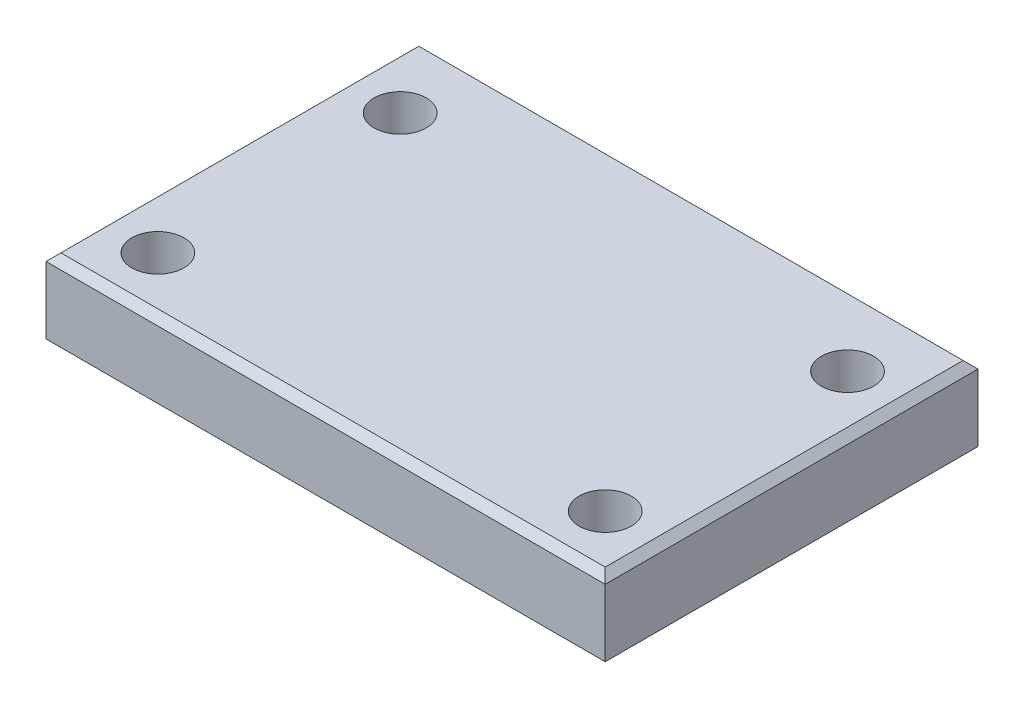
ISO-10303-21;
HEADER;
FILE_DESCRIPTION(('STEP AP214'),'2;1');
FILE_NAME('part.step','',(''),(''),'','','');
FILE_SCHEMA(('AUTOMOTIVE_DESIGN { 1 0 10303 214 1 1 1 1 }'));
ENDSEC;
DATA;
#1=APPLICATION_CONTEXT('core data for automotive mechanical design processes');
#2=APPLICATION_PROTOCOL_DEFINITION('international standard','automotive_design',2000,#1);
#3=PRODUCT_CONTEXT('',#1,'mechanical');
#4=PRODUCT('Part','Part','',(#3));
#5=PRODUCT_RELATED_PRODUCT_CATEGORY('part','',(#4));
#6=PRODUCT_DEFINITION_FORMATION('','',#4);
#7=PRODUCT_DEFINITION_CONTEXT('part definition',#1,'design');
#8=PRODUCT_DEFINITION('design','',#6,#7);
#9=PRODUCT_DEFINITION_SHAPE('','',#8);
#10=(LENGTH_UNIT() NAMED_UNIT(*) SI_UNIT(.MILLI.,.METRE.));
#11=(NAMED_UNIT(*) PLANE_ANGLE_UNIT() SI_UNIT($,.RADIAN.));
#12=(NAMED_UNIT(*) SI_UNIT($,.STERADIAN.) SOLID_ANGLE_UNIT());
#13=UNCERTAINTY_MEASURE_WITH_UNIT(LENGTH_MEASURE(1.E-05),#10,'distance_accuracy_value','');
#14=(GEOMETRIC_REPRESENTATION_CONTEXT(3) GLOBAL_UNCERTAINTY_ASSIGNED_CONTEXT((#13)) GLOBAL_UNIT_ASSIGNED_CONTEXT((#10,
#11,#12)) REPRESENTATION_CONTEXT('',''));
#15=CARTESIAN_POINT('',(0.,0.,0.));
#16=DIRECTION('',(0.,0.,1.));
#17=DIRECTION('',(1.,0.,0.));
#18=AXIS2_PLACEMENT_3D('',#15,#16,#17);
#19=CARTESIAN_POINT('',(-75.,20.,-50.));
#20=DIRECTION('',(1.,0.,0.));
#21=DIRECTION('',(0.,0.,-1.));
#22=AXIS2_PLACEMENT_3D('',#19,#20,#21);
#23=PLANE('',#22);
#24=DIRECTION('',(0.,-1.,0.));
#25=VECTOR('',#24,1.);
#26=CARTESIAN_POINT('',(-75.,20.,50.));
#27=LINE('',#26,#25);
#28=CARTESIAN_POINT('',(-75.,18.,50.));
#29=VERTEX_POINT('',#28);
#30=CARTESIAN_POINT('',(-75.,0.,50.));
#31=VERTEX_POINT('',#30);
#32=EDGE_CURVE('E80',#29,#31,#27,.T.);
#33=ORIENTED_EDGE('',*,*,#32,.F.);
#34=DIRECTION('',(0.,0.,-1.));
#35=VECTOR('',#34,1.);
#36=CARTESIAN_POINT('',(-75.,18.,-50.));
#37=LINE('',#36,#35);
#38=CARTESIAN_POINT('',(-75.,18.,-50.));
#39=VERTEX_POINT('',#38);
#40=EDGE_CURVE('E127',#29,#39,#37,.T.);
#41=ORIENTED_EDGE('',*,*,#40,.T.);
#42=DIRECTION('',(0.,-1.,0.));
#43=VECTOR('',#42,1.);
#44=CARTESIAN_POINT('',(-75.,20.,-50.));
#45=LINE('',#44,#43);
#46=CARTESIAN_POINT('',(-75.,0.,-50.));
#47=VERTEX_POINT('',#46);
#48=EDGE_CURVE('E103',#39,#47,#45,.T.);
#49=ORIENTED_EDGE('',*,*,#48,.T.);
#50=DIRECTION('',(0.,0.,1.));
#51=VECTOR('',#50,1.);
#52=CARTESIAN_POINT('',(-75.,0.,-50.));
#53=LINE('',#52,#51);
#54=EDGE_CURVE('E99',#47,#31,#53,.T.);
#55=ORIENTED_EDGE('',*,*,#54,.T.);
#56=EDGE_LOOP('',(#33,#41,#49,#55));
#57=FACE_BOUND('',#56,.T.);
#58=ADVANCED_FACE('F26',(#57),#23,.F.);
#59=CARTESIAN_POINT('',(-75.,20.,50.));
#60=DIRECTION('',(0.,0.,-1.));
#61=DIRECTION('',(-1.,0.,0.));
#62=AXIS2_PLACEMENT_3D('',#59,#60,#61);
#63=PLANE('',#62);
#64=DIRECTION('',(0.,-1.,0.));
#65=VECTOR('',#64,1.);
#66=CARTESIAN_POINT('',(75.,20.,50.));
#67=LINE('',#66,#65);
#68=CARTESIAN_POINT('',(75.,18.,50.));
#69=VERTEX_POINT('',#68);
#70=CARTESIAN_POINT('',(75.,0.,50.));
#71=VERTEX_POINT('',#70);
#72=EDGE_CURVE('E92',#69,#71,#67,.T.);
#73=ORIENTED_EDGE('',*,*,#72,.F.);
#74=DIRECTION('',(-1.,0.,0.));
#75=VECTOR('',#74,1.);
#76=CARTESIAN_POINT('',(-75.,18.,50.));
#77=LINE('',#76,#75);
#78=EDGE_CURVE('E86',#69,#29,#77,.T.);
#79=ORIENTED_EDGE('',*,*,#78,.T.);
#80=ORIENTED_EDGE('',*,*,#32,.T.);
#81=DIRECTION('',(1.,0.,0.));
#82=VECTOR('',#81,1.);
#83=CARTESIAN_POINT('',(-75.,0.,50.));
#84=LINE('',#83,#82);
#85=EDGE_CURVE('E83',#31,#71,#84,.T.);
#86=ORIENTED_EDGE('',*,*,#85,.T.);
#87=EDGE_LOOP('',(#73,#79,#80,#86));
#88=FACE_BOUND('',#87,.T.);
#89=ADVANCED_FACE('F82',(#88),#63,.F.);
#90=CARTESIAN_POINT('',(75.,20.,-50.));
#91=DIRECTION('',(-1.,0.,0.));
#92=DIRECTION('',(0.,0.,1.));
#93=AXIS2_PLACEMENT_3D('',#90,#91,#92);
#94=PLANE('',#93);
#95=DIRECTION('',(0.,-1.,0.));
#96=VECTOR('',#95,1.);
#97=CARTESIAN_POINT('',(75.,20.,-50.));
#98=LINE('',#97,#96);
#99=CARTESIAN_POINT('',(75.,18.,-50.));
#100=VERTEX_POINT('',#99);
#101=CARTESIAN_POINT('',(75.,0.,-50.));
#102=VERTEX_POINT('',#101);
#103=EDGE_CURVE('E116',#100,#102,#98,.T.);
#104=ORIENTED_EDGE('',*,*,#103,.F.);
#105=DIRECTION('',(0.,0.,1.));
#106=VECTOR('',#105,1.);
#107=CARTESIAN_POINT('',(75.,18.,50.));
#108=LINE('',#107,#106);
#109=EDGE_CURVE('E41',#100,#69,#108,.T.);
#110=ORIENTED_EDGE('',*,*,#109,.T.);
#111=ORIENTED_EDGE('',*,*,#72,.T.);
#112=DIRECTION('',(0.,0.,-1.));
#113=VECTOR('',#112,1.);
#114=CARTESIAN_POINT('',(75.,0.,-50.));
#115=LINE('',#114,#113);
#116=EDGE_CURVE('E101',#71,#102,#115,.T.);
#117=ORIENTED_EDGE('',*,*,#116,.T.);
#118=EDGE_LOOP('',(#104,#110,#111,#117));
#119=FACE_BOUND('',#118,.T.);
#120=ADVANCED_FACE('F159',(#119),#94,.F.);
#121=CARTESIAN_POINT('',(-75.,20.,-50.));
#122=DIRECTION('',(0.,0.,1.));
#123=DIRECTION('',(1.,0.,0.));
#124=AXIS2_PLACEMENT_3D('',#121,#122,#123);
#125=PLANE('',#124);
#126=ORIENTED_EDGE('',*,*,#48,.F.);
#127=DIRECTION('',(1.,0.,0.));
#128=VECTOR('',#127,1.);
#129=CARTESIAN_POINT('',(75.,18.,-50.));
#130=LINE('',#129,#128);
#131=EDGE_CURVE('E49',#39,#100,#130,.T.);
#132=ORIENTED_EDGE('',*,*,#131,.T.);
#133=ORIENTED_EDGE('',*,*,#103,.T.);
#134=DIRECTION('',(-1.,0.,0.));
#135=VECTOR('',#134,1.);
#136=CARTESIAN_POINT('',(-75.,0.,-50.));
#137=LINE('',#136,#135);
#138=EDGE_CURVE('E113',#102,#47,#137,.T.);
#139=ORIENTED_EDGE('',*,*,#138,.T.);
#140=EDGE_LOOP('',(#126,#132,#133,#139));
#141=FACE_BOUND('',#140,.T.);
#142=ADVANCED_FACE('F148',(#141),#125,.F.);
#143=CARTESIAN_POINT('',(-75.,20.,50.));
#144=DIRECTION('',(0.,1.,0.));
#145=DIRECTION('',(0.,0.,1.));
#146=AXIS2_PLACEMENT_3D('',#143,#144,#145);
#147=PLANE('',#146);
#148=CARTESIAN_POINT('',(-60.,20.,-30.));
#149=DIRECTION('',(0.,1.,0.));
#150=DIRECTION('',(0.,0.,1.));
#151=AXIS2_PLACEMENT_3D('',#148,#149,#150);
#152=CIRCLE('',#151,6.99999999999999);
#153=CARTESIAN_POINT('',(-60.,20.,-23.));
#154=VERTEX_POINT('',#153);
#155=EDGE_CURVE('E224',#154,#154,#152,.T.);
#156=ORIENTED_EDGE('',*,*,#155,.F.);
#157=EDGE_LOOP('',(#156));
#158=FACE_BOUND('',#157,.T.);
#159=CARTESIAN_POINT('',(-60.,20.,35.));
#160=DIRECTION('',(0.,1.,0.));
#161=DIRECTION('',(0.,0.,1.));
#162=AXIS2_PLACEMENT_3D('',#159,#160,#161);
#163=CIRCLE('',#162,6.99999999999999);
#164=CARTESIAN_POINT('',(-60.,20.,42.));
#165=VERTEX_POINT('',#164);
#166=EDGE_CURVE('E215',#165,#165,#163,.T.);
#167=ORIENTED_EDGE('',*,*,#166,.F.);
#168=EDGE_LOOP('',(#167));
#169=FACE_BOUND('',#168,.T.);
#170=DIRECTION('',(-1.,0.,0.));
#171=VECTOR('',#170,1.);
#172=CARTESIAN_POINT('',(-75.,20.,-48.));
#173=LINE('',#172,#171);
#174=CARTESIAN_POINT('',(73.,20.,-48.));
#175=VERTEX_POINT('',#174);
#176=CARTESIAN_POINT('',(-73.,20.,-48.));
#177=VERTEX_POINT('',#176);
#178=EDGE_CURVE('E122',#175,#177,#173,.T.);
#179=ORIENTED_EDGE('',*,*,#178,.T.);
#180=DIRECTION('',(0.,0.,1.));
#181=VECTOR('',#180,1.);
#182=CARTESIAN_POINT('',(-73.,20.,50.));
#183=LINE('',#182,#181);
#184=CARTESIAN_POINT('',(-73.,20.,48.));
#185=VERTEX_POINT('',#184);
#186=EDGE_CURVE('E124',#177,#185,#183,.T.);
#187=ORIENTED_EDGE('',*,*,#186,.T.);
#188=DIRECTION('',(1.,0.,0.));
#189=VECTOR('',#188,1.);
#190=CARTESIAN_POINT('',(75.,20.,48.));
#191=LINE('',#190,#189);
#192=CARTESIAN_POINT('',(73.,20.,48.));
#193=VERTEX_POINT('',#192);
#194=EDGE_CURVE('E91',#185,#193,#191,.T.);
#195=ORIENTED_EDGE('',*,*,#194,.T.);
#196=DIRECTION('',(0.,0.,-1.));
#197=VECTOR('',#196,1.);
#198=CARTESIAN_POINT('',(73.,20.,-50.));
#199=LINE('',#198,#197);
#200=EDGE_CURVE('E120',#193,#175,#199,.T.);
#201=ORIENTED_EDGE('',*,*,#200,.T.);
#202=EDGE_LOOP('',(#179,#187,#195,#201));
#203=FACE_BOUND('',#202,.T.);
#204=CARTESIAN_POINT('',(60.,20.,35.));
#205=DIRECTION('',(0.,1.,0.));
#206=DIRECTION('',(0.,0.,1.));
#207=AXIS2_PLACEMENT_3D('',#204,#205,#206);
#208=CIRCLE('',#207,6.99999999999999);
#209=CARTESIAN_POINT('',(60.,20.,42.));
#210=VERTEX_POINT('',#209);
#211=EDGE_CURVE('E135',#210,#210,#208,.T.);
#212=ORIENTED_EDGE('',*,*,#211,.F.);
#213=EDGE_LOOP('',(#212));
#214=FACE_BOUND('',#213,.T.);
#215=CARTESIAN_POINT('',(60.,20.,-30.));
#216=DIRECTION('',(0.,1.,0.));
#217=DIRECTION('',(0.,0.,1.));
#218=AXIS2_PLACEMENT_3D('',#215,#216,#217);
#219=CIRCLE('',#218,6.99999999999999);
#220=CARTESIAN_POINT('',(60.,20.,-23.));
#221=VERTEX_POINT('',#220);
#222=EDGE_CURVE('E11',#221,#221,#219,.T.);
#223=ORIENTED_EDGE('',*,*,#222,.F.);
#224=EDGE_LOOP('',(#223));
#225=FACE_BOUND('',#224,.T.);
#226=ADVANCED_FACE('F146',(#158,#169,#203,#214,#225),#147,.T.);
#227=CARTESIAN_POINT('',(-75.,0.,50.));
#228=DIRECTION('',(0.,1.,0.));
#229=DIRECTION('',(0.,0.,1.));
#230=AXIS2_PLACEMENT_3D('',#227,#228,#229);
#231=PLANE('',#230);
#232=CARTESIAN_POINT('',(-60.,0.,-30.));
#233=DIRECTION('',(0.,1.,0.));
#234=DIRECTION('',(0.,0.,1.));
#235=AXIS2_PLACEMENT_3D('',#232,#233,#234);
#236=CIRCLE('',#235,6.99999999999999);
#237=CARTESIAN_POINT('',(-60.,0.,-23.));
#238=VERTEX_POINT('',#237);
#239=EDGE_CURVE('E227',#238,#238,#236,.T.);
#240=ORIENTED_EDGE('',*,*,#239,.T.);
#241=EDGE_LOOP('',(#240));
#242=FACE_BOUND('',#241,.T.);
#243=CARTESIAN_POINT('',(-60.,0.,35.));
#244=DIRECTION('',(0.,1.,0.));
#245=DIRECTION('',(0.,0.,1.));
#246=AXIS2_PLACEMENT_3D('',#243,#244,#245);
#247=CIRCLE('',#246,6.99999999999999);
#248=CARTESIAN_POINT('',(-60.,0.,42.));
#249=VERTEX_POINT('',#248);
#250=EDGE_CURVE('E219',#249,#249,#247,.T.);
#251=ORIENTED_EDGE('',*,*,#250,.T.);
#252=EDGE_LOOP('',(#251));
#253=FACE_BOUND('',#252,.T.);
#254=ORIENTED_EDGE('',*,*,#54,.F.);
#255=ORIENTED_EDGE('',*,*,#138,.F.);
#256=ORIENTED_EDGE('',*,*,#116,.F.);
#257=ORIENTED_EDGE('',*,*,#85,.F.);
#258=EDGE_LOOP('',(#254,#255,#256,#257));
#259=FACE_BOUND('',#258,.T.);
#260=CARTESIAN_POINT('',(60.,0.,35.));
#261=DIRECTION('',(0.,1.,0.));
#262=DIRECTION('',(0.,0.,1.));
#263=AXIS2_PLACEMENT_3D('',#260,#261,#262);
#264=CIRCLE('',#263,6.99999999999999);
#265=CARTESIAN_POINT('',(60.,0.,42.));
#266=VERTEX_POINT('',#265);
#267=EDGE_CURVE('E132',#266,#266,#264,.T.);
#268=ORIENTED_EDGE('',*,*,#267,.T.);
#269=EDGE_LOOP('',(#268));
#270=FACE_BOUND('',#269,.T.);
#271=CARTESIAN_POINT('',(60.,0.,-30.));
#272=DIRECTION('',(0.,1.,0.));
#273=DIRECTION('',(0.,0.,1.));
#274=AXIS2_PLACEMENT_3D('',#271,#272,#273);
#275=CIRCLE('',#274,6.99999999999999);
#276=CARTESIAN_POINT('',(60.,0.,-23.));
#277=VERTEX_POINT('',#276);
#278=EDGE_CURVE('E34',#277,#277,#275,.T.);
#279=ORIENTED_EDGE('',*,*,#278,.T.);
#280=EDGE_LOOP('',(#279));
#281=FACE_BOUND('',#280,.T.);
#282=ADVANCED_FACE('F96',(#242,#253,#259,#270,#281),#231,.F.);
#283=CARTESIAN_POINT('',(73.,20.,50.));
#284=DIRECTION('',(0.707106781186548,0.707106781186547,0.));
#285=DIRECTION('',(-0.707106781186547,0.707106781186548,0.));
#286=AXIS2_PLACEMENT_3D('',#283,#284,#285);
#287=PLANE('',#286);
#288=DIRECTION('',(-0.577350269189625,0.577350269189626,-0.577350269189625));
#289=VECTOR('',#288,1.);
#290=CARTESIAN_POINT('',(23.6666666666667,69.3333333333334,-1.33333333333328));
#291=LINE('',#290,#289);
#292=EDGE_CURVE('E108',#69,#193,#291,.T.);
#293=ORIENTED_EDGE('',*,*,#292,.F.);
#294=ORIENTED_EDGE('',*,*,#109,.F.);
#295=DIRECTION('',(-0.577350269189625,0.577350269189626,0.577350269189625));
#296=VECTOR('',#295,1.);
#297=CARTESIAN_POINT('',(40.3333333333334,52.6666666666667,-15.3333333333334));
#298=LINE('',#297,#296);
#299=EDGE_CURVE('E105',#175,#100,#298,.F.);
#300=ORIENTED_EDGE('',*,*,#299,.F.);
#301=ORIENTED_EDGE('',*,*,#200,.F.);
#302=EDGE_LOOP('',(#293,#294,#300,#301));
#303=FACE_BOUND('',#302,.T.);
#304=ADVANCED_FACE('F155',(#303),#287,.T.);
#305=CARTESIAN_POINT('',(-75.,20.,-48.));
#306=DIRECTION('',(0.,0.707106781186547,-0.707106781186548));
#307=DIRECTION('',(0.,0.707106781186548,0.707106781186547));
#308=AXIS2_PLACEMENT_3D('',#305,#306,#307);
#309=PLANE('',#308);
#310=ORIENTED_EDGE('',*,*,#299,.T.);
#311=ORIENTED_EDGE('',*,*,#131,.F.);
#312=DIRECTION('',(0.577350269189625,0.577350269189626,0.577350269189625));
#313=VECTOR('',#312,1.);
#314=CARTESIAN_POINT('',(-73.6666666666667,19.3333333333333,-48.6666666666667));
#315=LINE('',#314,#313);
#316=EDGE_CURVE('E211',#177,#39,#315,.F.);
#317=ORIENTED_EDGE('',*,*,#316,.F.);
#318=ORIENTED_EDGE('',*,*,#178,.F.);
#319=EDGE_LOOP('',(#310,#311,#317,#318));
#320=FACE_BOUND('',#319,.T.);
#321=ADVANCED_FACE('F197',(#320),#309,.T.);
#322=CARTESIAN_POINT('',(-75.,20.,48.));
#323=DIRECTION('',(0.,0.707106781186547,0.707106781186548));
#324=DIRECTION('',(0.,-0.707106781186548,0.707106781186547));
#325=AXIS2_PLACEMENT_3D('',#322,#323,#324);
#326=PLANE('',#325);
#327=ORIENTED_EDGE('',*,*,#292,.T.);
#328=ORIENTED_EDGE('',*,*,#194,.F.);
#329=DIRECTION('',(-0.577350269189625,-0.577350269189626,0.577350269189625));
#330=VECTOR('',#329,1.);
#331=CARTESIAN_POINT('',(-73.6666666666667,19.3333333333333,48.6666666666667));
#332=LINE('',#331,#330);
#333=EDGE_CURVE('E213',#29,#185,#332,.F.);
#334=ORIENTED_EDGE('',*,*,#333,.F.);
#335=ORIENTED_EDGE('',*,*,#78,.F.);
#336=EDGE_LOOP('',(#327,#328,#334,#335));
#337=FACE_BOUND('',#336,.T.);
#338=ADVANCED_FACE('F193',(#337),#326,.T.);
#339=CARTESIAN_POINT('',(-73.,20.,50.));
#340=DIRECTION('',(-0.707106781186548,0.707106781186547,0.));
#341=DIRECTION('',(-0.707106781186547,-0.707106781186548,0.));
#342=AXIS2_PLACEMENT_3D('',#339,#340,#341);
#343=PLANE('',#342);
#344=ORIENTED_EDGE('',*,*,#316,.T.);
#345=ORIENTED_EDGE('',*,*,#40,.F.);
#346=ORIENTED_EDGE('',*,*,#333,.T.);
#347=ORIENTED_EDGE('',*,*,#186,.F.);
#348=EDGE_LOOP('',(#344,#345,#346,#347));
#349=FACE_BOUND('',#348,.T.);
#350=ADVANCED_FACE('F185',(#349),#343,.T.);
#351=CARTESIAN_POINT('',(-60.,20.,35.));
#352=DIRECTION('',(0.,1.,0.));
#353=DIRECTION('',(0.,0.,1.));
#354=AXIS2_PLACEMENT_3D('',#351,#352,#353);
#355=CYLINDRICAL_SURFACE('',#354,6.99999999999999);
#356=ORIENTED_EDGE('',*,*,#250,.F.);
#357=EDGE_LOOP('',(#356));
#358=FACE_BOUND('',#357,.T.);
#359=ORIENTED_EDGE('',*,*,#166,.T.);
#360=EDGE_LOOP('',(#359));
#361=FACE_BOUND('',#360,.T.);
#362=ADVANCED_FACE('F176',(#358,#361),#355,.F.);
#363=CARTESIAN_POINT('',(-60.,20.,-30.));
#364=DIRECTION('',(0.,1.,0.));
#365=DIRECTION('',(0.,0.,1.));
#366=AXIS2_PLACEMENT_3D('',#363,#364,#365);
#367=CYLINDRICAL_SURFACE('',#366,6.99999999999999);
#368=ORIENTED_EDGE('',*,*,#239,.F.);
#369=EDGE_LOOP('',(#368));
#370=FACE_BOUND('',#369,.T.);
#371=ORIENTED_EDGE('',*,*,#155,.T.);
#372=EDGE_LOOP('',(#371));
#373=FACE_BOUND('',#372,.T.);
#374=ADVANCED_FACE('F171',(#370,#373),#367,.F.);
#375=CARTESIAN_POINT('',(60.,20.,35.));
#376=DIRECTION('',(0.,1.,0.));
#377=DIRECTION('',(0.,0.,1.));
#378=AXIS2_PLACEMENT_3D('',#375,#376,#377);
#379=CYLINDRICAL_SURFACE('',#378,6.99999999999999);
#380=ORIENTED_EDGE('',*,*,#267,.F.);
#381=EDGE_LOOP('',(#380));
#382=FACE_BOUND('',#381,.T.);
#383=ORIENTED_EDGE('',*,*,#211,.T.);
#384=EDGE_LOOP('',(#383));
#385=FACE_BOUND('',#384,.T.);
#386=ADVANCED_FACE('F143',(#382,#385),#379,.F.);
#387=CARTESIAN_POINT('',(60.,20.,-30.));
#388=DIRECTION('',(0.,1.,0.));
#389=DIRECTION('',(0.,0.,1.));
#390=AXIS2_PLACEMENT_3D('',#387,#388,#389);
#391=CYLINDRICAL_SURFACE('',#390,6.99999999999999);
#392=ORIENTED_EDGE('',*,*,#278,.F.);
#393=EDGE_LOOP('',(#392));
#394=FACE_BOUND('',#393,.T.);
#395=ORIENTED_EDGE('',*,*,#222,.T.);
#396=EDGE_LOOP('',(#395));
#397=FACE_BOUND('',#396,.T.);
#398=ADVANCED_FACE('F28',(#394,#397),#391,.F.);
#399=CLOSED_SHELL('',(#58,#89,#120,#142,#226,#282,#304,#321,#338,#350,#362,#374,#386,#398));
#400=MANIFOLD_SOLID_BREP('B2',#399);
#401=ADVANCED_BREP_SHAPE_REPRESENTATION('',(#18,#400),#14);
#402=SHAPE_DEFINITION_REPRESENTATION(#9,#401);
ENDSEC;
END-ISO-10303-21;
